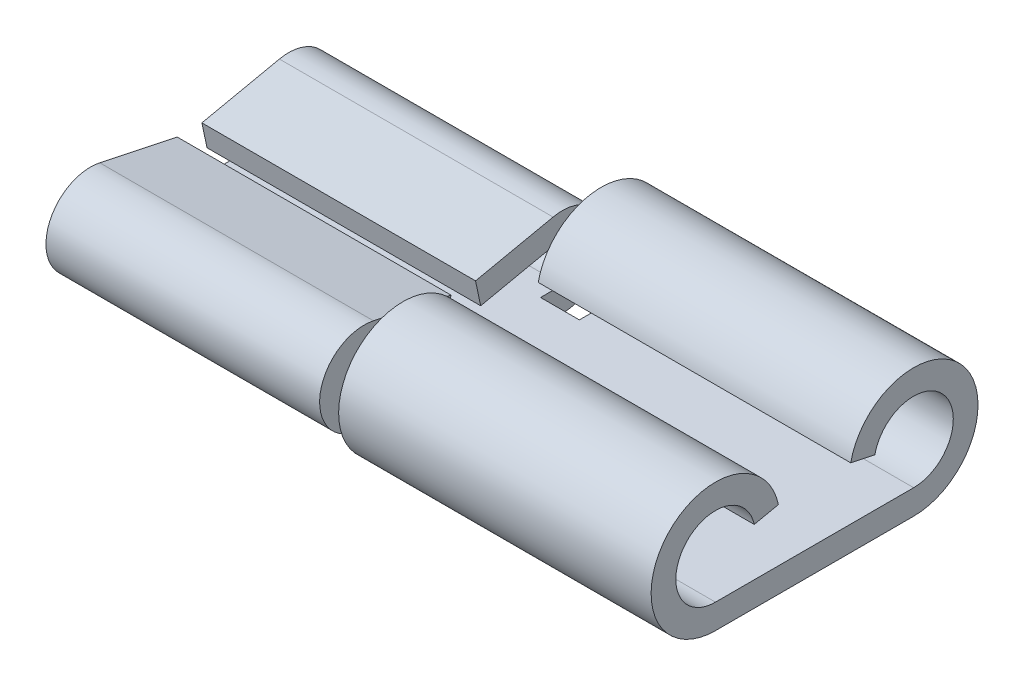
ISO-10303-21;
HEADER;
FILE_DESCRIPTION(('STEP AP214'),'2;1');
FILE_NAME('part.step','',(''),(''),'','','');
FILE_SCHEMA(('AUTOMOTIVE_DESIGN { 1 0 10303 214 1 1 1 1 }'));
ENDSEC;
DATA;
#1=APPLICATION_CONTEXT('core data for automotive mechanical design processes');
#2=APPLICATION_PROTOCOL_DEFINITION('international standard','automotive_design',2000,#1);
#3=PRODUCT_CONTEXT('',#1,'mechanical');
#4=PRODUCT('Part','Part','',(#3));
#5=PRODUCT_RELATED_PRODUCT_CATEGORY('part','',(#4));
#6=PRODUCT_DEFINITION_FORMATION('','',#4);
#7=PRODUCT_DEFINITION_CONTEXT('part definition',#1,'design');
#8=PRODUCT_DEFINITION('design','',#6,#7);
#9=PRODUCT_DEFINITION_SHAPE('','',#8);
#10=(LENGTH_UNIT() NAMED_UNIT(*) SI_UNIT(.MILLI.,.METRE.));
#11=(NAMED_UNIT(*) PLANE_ANGLE_UNIT() SI_UNIT($,.RADIAN.));
#12=(NAMED_UNIT(*) SI_UNIT($,.STERADIAN.) SOLID_ANGLE_UNIT());
#13=UNCERTAINTY_MEASURE_WITH_UNIT(LENGTH_MEASURE(1.E-05),#10,'distance_accuracy_value','');
#14=(GEOMETRIC_REPRESENTATION_CONTEXT(3) GLOBAL_UNCERTAINTY_ASSIGNED_CONTEXT((#13)) GLOBAL_UNIT_ASSIGNED_CONTEXT((#10,
#11,#12)) REPRESENTATION_CONTEXT('',''));
#15=CARTESIAN_POINT('',(0.,0.,0.));
#16=DIRECTION('',(0.,0.,1.));
#17=DIRECTION('',(1.,0.,0.));
#18=AXIS2_PLACEMENT_3D('',#15,#16,#17);
#19=CARTESIAN_POINT('',(-3.37666237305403,0.911796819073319,-0.335088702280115));
#20=DIRECTION('',(0.,-0.207911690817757,0.978147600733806));
#21=DIRECTION('',(0.,-0.978147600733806,-0.207911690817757));
#22=AXIS2_PLACEMENT_3D('',#19,#20,#21);
#23=PLANE('',#22);
#24=DIRECTION('',(1.,0.,0.));
#25=VECTOR('',#24,1.);
#26=CARTESIAN_POINT('',(-3.37666237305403,0.911796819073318,-0.335088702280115));
#27=LINE('',#26,#25);
#28=CARTESIAN_POINT('',(-6.0071,0.911796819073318,-0.335088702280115));
#29=VERTEX_POINT('',#28);
#30=CARTESIAN_POINT('',(-0.746224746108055,0.911796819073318,-0.335088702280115));
#31=VERTEX_POINT('',#30);
#32=EDGE_CURVE('E195',#29,#31,#27,.T.);
#33=ORIENTED_EDGE('',*,*,#32,.T.);
#34=DIRECTION('',(0.,-0.978147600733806,-0.207911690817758));
#35=VECTOR('',#34,1.);
#36=CARTESIAN_POINT('',(-0.746224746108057,1.37639736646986,-0.236334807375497));
#37=LINE('',#36,#35);
#38=CARTESIAN_POINT('',(-0.746224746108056,1.37639736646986,-0.236334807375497));
#39=VERTEX_POINT('',#38);
#40=EDGE_CURVE('E302',#39,#31,#37,.T.);
#41=ORIENTED_EDGE('',*,*,#40,.F.);
#42=DIRECTION('',(1.,0.,0.));
#43=VECTOR('',#42,1.);
#44=CARTESIAN_POINT('',(-3.37666237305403,1.37639736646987,-0.236334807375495));
#45=LINE('',#44,#43);
#46=CARTESIAN_POINT('',(-6.0071,1.37639736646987,-0.236334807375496));
#47=VERTEX_POINT('',#46);
#48=EDGE_CURVE('E201',#47,#39,#45,.T.);
#49=ORIENTED_EDGE('',*,*,#48,.F.);
#50=DIRECTION('',(0.,-0.978147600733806,-0.207911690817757));
#51=VECTOR('',#50,1.);
#52=CARTESIAN_POINT('',(-6.0071,0.911796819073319,-0.335088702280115));
#53=LINE('',#52,#51);
#54=EDGE_CURVE('E188',#47,#29,#53,.T.);
#55=ORIENTED_EDGE('',*,*,#54,.T.);
#56=EDGE_LOOP('',(#33,#41,#49,#55));
#57=FACE_BOUND('',#56,.T.);
#58=ADVANCED_FACE('F17',(#57),#23,.T.);
#59=CARTESIAN_POINT('',(-3.37666237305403,1.62849005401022,-1.4223376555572));
#60=DIRECTION('',(0.,0.978147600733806,0.207911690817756));
#61=DIRECTION('',(0.,-0.207911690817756,0.978147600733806));
#62=AXIS2_PLACEMENT_3D('',#59,#60,#61);
#63=PLANE('',#62);
#64=ORIENTED_EDGE('',*,*,#48,.T.);
#65=DIRECTION('',(0.,-0.207911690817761,0.978147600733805));
#66=VECTOR('',#65,1.);
#67=CARTESIAN_POINT('',(-0.746224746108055,1.69325478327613,-1.72703175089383));
#68=LINE('',#67,#66);
#69=CARTESIAN_POINT('',(-0.746224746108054,1.69325478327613,-1.72703175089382));
#70=VERTEX_POINT('',#69);
#71=EDGE_CURVE('E308',#70,#39,#68,.T.);
#72=ORIENTED_EDGE('',*,*,#71,.F.);
#73=DIRECTION('',(1.,0.,0.));
#74=VECTOR('',#73,1.);
#75=CARTESIAN_POINT('',(-6.00710000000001,1.69325478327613,-1.72703175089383));
#76=LINE('',#75,#74);
#77=CARTESIAN_POINT('',(-6.0071,1.69325478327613,-1.72703175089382));
#78=VERTEX_POINT('',#77);
#79=EDGE_CURVE('E209',#78,#70,#76,.T.);
#80=ORIENTED_EDGE('',*,*,#79,.F.);
#81=DIRECTION('',(0.,-0.207911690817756,0.978147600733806));
#82=VECTOR('',#81,1.);
#83=CARTESIAN_POINT('',(-6.0071,1.62849005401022,-1.4223376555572));
#84=LINE('',#83,#82);
#85=EDGE_CURVE('E203',#78,#47,#84,.T.);
#86=ORIENTED_EDGE('',*,*,#85,.T.);
#87=EDGE_LOOP('',(#64,#72,#80,#86));
#88=FACE_BOUND('',#87,.T.);
#89=ADVANCED_FACE('F328',(#88),#63,.T.);
#90=CARTESIAN_POINT('',(-0.746224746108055,0.,-1.69521083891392));
#91=DIRECTION('',(1.,0.,0.));
#92=DIRECTION('',(0.,0.,-1.));
#93=AXIS2_PLACEMENT_3D('',#90,#91,#92);
#94=PLANE('',#93);
#95=DIRECTION('',(0.,-0.207911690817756,0.978147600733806));
#96=VECTOR('',#95,1.);
#97=CARTESIAN_POINT('',(-0.746224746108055,1.16388950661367,-1.52109155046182));
#98=LINE('',#97,#96);
#99=CARTESIAN_POINT('',(-0.746224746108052,1.22865423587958,-1.82578564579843));
#100=VERTEX_POINT('',#99);
#101=EDGE_CURVE('E207',#31,#100,#98,.F.);
#102=ORIENTED_EDGE('',*,*,#101,.T.);
#103=CARTESIAN_POINT('',(-0.746224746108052,0.85598,-1.905));
#104=DIRECTION('',(1.,0.,0.));
#105=DIRECTION('',(0.,0.,-1.));
#106=AXIS2_PLACEMENT_3D('',#103,#104,#105);
#107=CIRCLE('',#106,0.381000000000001);
#108=CARTESIAN_POINT('',(-0.746224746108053,0.47498,-1.905));
#109=VERTEX_POINT('',#108);
#110=EDGE_CURVE('E20',#100,#109,#107,.F.);
#111=ORIENTED_EDGE('',*,*,#110,.T.);
#112=DIRECTION('',(0.,0.,-1.));
#113=VECTOR('',#112,1.);
#114=CARTESIAN_POINT('',(-0.746224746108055,0.47498,-1.69521083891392));
#115=LINE('',#114,#113);
#116=CARTESIAN_POINT('',(-0.746224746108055,0.47498,-1.48542167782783));
#117=VERTEX_POINT('',#116);
#118=EDGE_CURVE('E234',#109,#117,#115,.F.);
#119=ORIENTED_EDGE('',*,*,#118,.T.);
#120=DIRECTION('',(0.,1.,0.));
#121=VECTOR('',#120,1.);
#122=CARTESIAN_POINT('',(-0.746224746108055,0.,-1.48542167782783));
#123=LINE('',#122,#121);
#124=CARTESIAN_POINT('',(-0.746224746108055,0.,-1.48542167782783));
#125=VERTEX_POINT('',#124);
#126=EDGE_CURVE('E237',#117,#125,#123,.F.);
#127=ORIENTED_EDGE('',*,*,#126,.T.);
#128=DIRECTION('',(0.,0.,-1.));
#129=VECTOR('',#128,1.);
#130=CARTESIAN_POINT('',(-0.746224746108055,0.,-1.69521083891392));
#131=LINE('',#130,#129);
#132=CARTESIAN_POINT('',(-0.746224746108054,0.,-1.905));
#133=VERTEX_POINT('',#132);
#134=EDGE_CURVE('E240',#125,#133,#131,.T.);
#135=ORIENTED_EDGE('',*,*,#134,.T.);
#136=CARTESIAN_POINT('',(-0.746224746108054,0.85598,-1.905));
#137=DIRECTION('',(1.,0.,0.));
#138=DIRECTION('',(0.,1.,0.));
#139=AXIS2_PLACEMENT_3D('',#136,#137,#138);
#140=CIRCLE('',#139,0.855979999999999);
#141=EDGE_CURVE('E292',#70,#133,#140,.F.);
#142=ORIENTED_EDGE('',*,*,#141,.F.);
#143=ORIENTED_EDGE('',*,*,#71,.T.);
#144=ORIENTED_EDGE('',*,*,#40,.T.);
#145=EDGE_LOOP('',(#102,#111,#119,#127,#135,#142,#143,#144));
#146=FACE_BOUND('',#145,.T.);
#147=ADVANCED_FACE('F323',(#146),#94,.T.);
#148=CARTESIAN_POINT('',(-0.746224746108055,0.,1.69521083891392));
#149=DIRECTION('',(1.,0.,0.));
#150=DIRECTION('',(0.,0.,-1.));
#151=AXIS2_PLACEMENT_3D('',#148,#149,#150);
#152=PLANE('',#151);
#153=DIRECTION('',(0.,0.,-1.));
#154=VECTOR('',#153,1.);
#155=CARTESIAN_POINT('',(-0.746224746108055,0.,1.69521083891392));
#156=LINE('',#155,#154);
#157=CARTESIAN_POINT('',(-0.746224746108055,0.,1.905));
#158=VERTEX_POINT('',#157);
#159=CARTESIAN_POINT('',(-0.746224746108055,0.,1.48542167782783));
#160=VERTEX_POINT('',#159);
#161=EDGE_CURVE('E230',#158,#160,#156,.T.);
#162=ORIENTED_EDGE('',*,*,#161,.T.);
#163=DIRECTION('',(0.,1.,0.));
#164=VECTOR('',#163,1.);
#165=CARTESIAN_POINT('',(-0.746224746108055,0.,1.48542167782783));
#166=LINE('',#165,#164);
#167=CARTESIAN_POINT('',(-0.746224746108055,0.47498,1.48542167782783));
#168=VERTEX_POINT('',#167);
#169=EDGE_CURVE('E226',#160,#168,#166,.T.);
#170=ORIENTED_EDGE('',*,*,#169,.T.);
#171=DIRECTION('',(0.,0.,-1.));
#172=VECTOR('',#171,1.);
#173=CARTESIAN_POINT('',(-0.746224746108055,0.47498,1.69521083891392));
#174=LINE('',#173,#172);
#175=CARTESIAN_POINT('',(-0.746224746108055,0.47498,1.905));
#176=VERTEX_POINT('',#175);
#177=EDGE_CURVE('E297',#168,#176,#174,.F.);
#178=ORIENTED_EDGE('',*,*,#177,.T.);
#179=CARTESIAN_POINT('',(-0.746224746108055,0.85598,1.905));
#180=DIRECTION('',(1.,0.,0.));
#181=DIRECTION('',(0.,0.,-1.));
#182=AXIS2_PLACEMENT_3D('',#179,#180,#181);
#183=CIRCLE('',#182,0.381000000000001);
#184=CARTESIAN_POINT('',(-0.746224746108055,1.22865423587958,1.82578564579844));
#185=VERTEX_POINT('',#184);
#186=EDGE_CURVE('E294',#176,#185,#183,.F.);
#187=ORIENTED_EDGE('',*,*,#186,.T.);
#188=DIRECTION('',(0.,-0.207911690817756,-0.978147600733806));
#189=VECTOR('',#188,1.);
#190=CARTESIAN_POINT('',(-0.746224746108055,1.22865423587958,1.82578564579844));
#191=LINE('',#190,#189);
#192=CARTESIAN_POINT('',(-0.746224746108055,0.911796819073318,0.335088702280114));
#193=VERTEX_POINT('',#192);
#194=EDGE_CURVE('E296',#185,#193,#191,.T.);
#195=ORIENTED_EDGE('',*,*,#194,.T.);
#196=DIRECTION('',(0.,0.978147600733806,-0.207911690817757));
#197=VECTOR('',#196,1.);
#198=CARTESIAN_POINT('',(-0.746224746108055,0.911796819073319,0.335088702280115));
#199=LINE('',#198,#197);
#200=CARTESIAN_POINT('',(-0.746224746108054,1.37639736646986,0.236334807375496));
#201=VERTEX_POINT('',#200);
#202=EDGE_CURVE('E222',#201,#193,#199,.F.);
#203=ORIENTED_EDGE('',*,*,#202,.F.);
#204=DIRECTION('',(0.,0.207911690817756,0.978147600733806));
#205=VECTOR('',#204,1.);
#206=CARTESIAN_POINT('',(-0.746224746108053,1.62849005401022,1.4223376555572));
#207=LINE('',#206,#205);
#208=CARTESIAN_POINT('',(-0.746224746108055,1.69325478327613,1.72703175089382));
#209=VERTEX_POINT('',#208);
#210=EDGE_CURVE('E229',#209,#201,#207,.F.);
#211=ORIENTED_EDGE('',*,*,#210,.F.);
#212=CARTESIAN_POINT('',(-0.746224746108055,0.85598,1.905));
#213=DIRECTION('',(1.,0.,0.));
#214=DIRECTION('',(0.,0.,-1.));
#215=AXIS2_PLACEMENT_3D('',#212,#213,#214);
#216=CIRCLE('',#215,0.85598);
#217=EDGE_CURVE('E288',#158,#209,#216,.F.);
#218=ORIENTED_EDGE('',*,*,#217,.F.);
#219=EDGE_LOOP('',(#162,#170,#178,#187,#195,#203,#211,#218));
#220=FACE_BOUND('',#219,.T.);
#221=ADVANCED_FACE('F442',(#220),#152,.T.);
#222=CARTESIAN_POINT('',(-3.37666237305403,1.62849005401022,1.4223376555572));
#223=DIRECTION('',(0.,0.978147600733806,-0.207911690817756));
#224=DIRECTION('',(0.,0.207911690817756,0.978147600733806));
#225=AXIS2_PLACEMENT_3D('',#222,#223,#224);
#226=PLANE('',#225);
#227=DIRECTION('',(1.,0.,0.));
#228=VECTOR('',#227,1.);
#229=CARTESIAN_POINT('',(-3.37666237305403,1.37639736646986,0.236334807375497));
#230=LINE('',#229,#228);
#231=CARTESIAN_POINT('',(-6.0071,1.37639736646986,0.236334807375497));
#232=VERTEX_POINT('',#231);
#233=EDGE_CURVE('E219',#232,#201,#230,.T.);
#234=ORIENTED_EDGE('',*,*,#233,.F.);
#235=DIRECTION('',(0.,0.207911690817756,0.978147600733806));
#236=VECTOR('',#235,1.);
#237=CARTESIAN_POINT('',(-6.0071,1.62849005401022,1.4223376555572));
#238=LINE('',#237,#236);
#239=CARTESIAN_POINT('',(-6.0071,1.69325478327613,1.72703175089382));
#240=VERTEX_POINT('',#239);
#241=EDGE_CURVE('E223',#232,#240,#238,.T.);
#242=ORIENTED_EDGE('',*,*,#241,.T.);
#243=DIRECTION('',(1.,0.,0.));
#244=VECTOR('',#243,1.);
#245=CARTESIAN_POINT('',(-6.0071,1.69325478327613,1.72703175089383));
#246=LINE('',#245,#244);
#247=EDGE_CURVE('E291',#209,#240,#246,.F.);
#248=ORIENTED_EDGE('',*,*,#247,.F.);
#249=ORIENTED_EDGE('',*,*,#210,.T.);
#250=EDGE_LOOP('',(#234,#242,#248,#249));
#251=FACE_BOUND('',#250,.T.);
#252=ADVANCED_FACE('F672',(#251),#226,.T.);
#253=CARTESIAN_POINT('',(-3.37666237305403,0.911796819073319,0.335088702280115));
#254=DIRECTION('',(0.,-0.207911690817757,-0.978147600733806));
#255=DIRECTION('',(0.,0.978147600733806,-0.207911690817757));
#256=AXIS2_PLACEMENT_3D('',#253,#254,#255);
#257=PLANE('',#256);
#258=DIRECTION('',(1.,0.,0.));
#259=VECTOR('',#258,1.);
#260=CARTESIAN_POINT('',(-3.37666237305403,0.911796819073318,0.335088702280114));
#261=LINE('',#260,#259);
#262=CARTESIAN_POINT('',(-6.0071,0.911796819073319,0.335088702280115));
#263=VERTEX_POINT('',#262);
#264=EDGE_CURVE('E385',#193,#263,#261,.F.);
#265=ORIENTED_EDGE('',*,*,#264,.T.);
#266=DIRECTION('',(0.,0.978147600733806,-0.207911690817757));
#267=VECTOR('',#266,1.);
#268=CARTESIAN_POINT('',(-6.0071,0.911796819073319,0.335088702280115));
#269=LINE('',#268,#267);
#270=EDGE_CURVE('E196',#263,#232,#269,.T.);
#271=ORIENTED_EDGE('',*,*,#270,.T.);
#272=ORIENTED_EDGE('',*,*,#233,.T.);
#273=ORIENTED_EDGE('',*,*,#202,.T.);
#274=EDGE_LOOP('',(#265,#271,#272,#273));
#275=FACE_BOUND('',#274,.T.);
#276=ADVANCED_FACE('F664',(#275),#257,.T.);
#277=CARTESIAN_POINT('',(-3.37666237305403,1.16388950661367,-1.52109155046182));
#278=DIRECTION('',(0.,0.978147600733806,0.207911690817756));
#279=DIRECTION('',(0.,-0.207911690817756,0.978147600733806));
#280=AXIS2_PLACEMENT_3D('',#277,#278,#279);
#281=PLANE('',#280);
#282=ORIENTED_EDGE('',*,*,#101,.F.);
#283=ORIENTED_EDGE('',*,*,#32,.F.);
#284=DIRECTION('',(0.,-0.207911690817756,0.978147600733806));
#285=VECTOR('',#284,1.);
#286=CARTESIAN_POINT('',(-6.0071,1.16388950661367,-1.52109155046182));
#287=LINE('',#286,#285);
#288=CARTESIAN_POINT('',(-6.0071,1.22865423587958,-1.82578564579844));
#289=VERTEX_POINT('',#288);
#290=EDGE_CURVE('E184',#289,#29,#287,.T.);
#291=ORIENTED_EDGE('',*,*,#290,.F.);
#292=DIRECTION('',(1.,0.,0.));
#293=VECTOR('',#292,1.);
#294=CARTESIAN_POINT('',(-6.0071,1.22865423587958,-1.82578564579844));
#295=LINE('',#294,#293);
#296=EDGE_CURVE('E277',#289,#100,#295,.T.);
#297=ORIENTED_EDGE('',*,*,#296,.T.);
#298=EDGE_LOOP('',(#282,#283,#291,#297));
#299=FACE_BOUND('',#298,.T.);
#300=ADVANCED_FACE('F206',(#299),#281,.F.);
#301=CARTESIAN_POINT('',(-6.00710000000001,0.855980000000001,-1.905));
#302=DIRECTION('',(1.,0.,0.));
#303=DIRECTION('',(0.,1.,0.));
#304=AXIS2_PLACEMENT_3D('',#301,#302,#303);
#305=CYLINDRICAL_SURFACE('',#304,0.855979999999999);
#306=ORIENTED_EDGE('',*,*,#79,.T.);
#307=ORIENTED_EDGE('',*,*,#141,.T.);
#308=DIRECTION('',(1.,0.,0.));
#309=VECTOR('',#308,1.);
#310=CARTESIAN_POINT('',(-0.0187897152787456,0.,-1.905));
#311=LINE('',#310,#309);
#312=CARTESIAN_POINT('',(-6.0071,0.,-1.905));
#313=VERTEX_POINT('',#312);
#314=EDGE_CURVE('E335',#133,#313,#311,.F.);
#315=ORIENTED_EDGE('',*,*,#314,.T.);
#316=CARTESIAN_POINT('',(-6.0071,0.855980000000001,-1.905));
#317=DIRECTION('',(1.,0.,0.));
#318=DIRECTION('',(0.,1.,0.));
#319=AXIS2_PLACEMENT_3D('',#316,#317,#318);
#320=CIRCLE('',#319,0.855979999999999);
#321=EDGE_CURVE('E273',#78,#313,#320,.F.);
#322=ORIENTED_EDGE('',*,*,#321,.F.);
#323=EDGE_LOOP('',(#306,#307,#315,#322));
#324=FACE_BOUND('',#323,.T.);
#325=ADVANCED_FACE('F333',(#324),#305,.T.);
#326=CARTESIAN_POINT('',(-6.0071,0.85598,1.905));
#327=DIRECTION('',(1.,0.,0.));
#328=DIRECTION('',(0.,0.,-1.));
#329=AXIS2_PLACEMENT_3D('',#326,#327,#328);
#330=CYLINDRICAL_SURFACE('',#329,0.85598);
#331=ORIENTED_EDGE('',*,*,#247,.T.);
#332=CARTESIAN_POINT('',(-6.0071,0.85598,1.905));
#333=DIRECTION('',(1.,0.,0.));
#334=DIRECTION('',(0.,0.,-1.));
#335=AXIS2_PLACEMENT_3D('',#332,#333,#334);
#336=CIRCLE('',#335,0.85598);
#337=CARTESIAN_POINT('',(-6.0071,0.,1.905));
#338=VERTEX_POINT('',#337);
#339=EDGE_CURVE('E268',#338,#240,#336,.F.);
#340=ORIENTED_EDGE('',*,*,#339,.F.);
#341=DIRECTION('',(1.,0.,0.));
#342=VECTOR('',#341,1.);
#343=CARTESIAN_POINT('',(-0.0187897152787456,0.,1.905));
#344=LINE('',#343,#342);
#345=EDGE_CURVE('E286',#338,#158,#344,.T.);
#346=ORIENTED_EDGE('',*,*,#345,.T.);
#347=ORIENTED_EDGE('',*,*,#217,.T.);
#348=EDGE_LOOP('',(#331,#340,#346,#347));
#349=FACE_BOUND('',#348,.T.);
#350=ADVANCED_FACE('F641',(#349),#330,.T.);
#351=CARTESIAN_POINT('',(-3.37666237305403,1.16388950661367,1.52109155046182));
#352=DIRECTION('',(0.,0.978147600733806,-0.207911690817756));
#353=DIRECTION('',(0.,0.207911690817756,0.978147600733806));
#354=AXIS2_PLACEMENT_3D('',#351,#352,#353);
#355=PLANE('',#354);
#356=DIRECTION('',(0.,0.207911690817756,0.978147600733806));
#357=VECTOR('',#356,1.);
#358=CARTESIAN_POINT('',(-6.0071,0.911796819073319,0.335088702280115));
#359=LINE('',#358,#357);
#360=CARTESIAN_POINT('',(-6.0071,1.22865423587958,1.82578564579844));
#361=VERTEX_POINT('',#360);
#362=EDGE_CURVE('E271',#263,#361,#359,.T.);
#363=ORIENTED_EDGE('',*,*,#362,.F.);
#364=ORIENTED_EDGE('',*,*,#264,.F.);
#365=ORIENTED_EDGE('',*,*,#194,.F.);
#366=DIRECTION('',(1.,0.,0.));
#367=VECTOR('',#366,1.);
#368=CARTESIAN_POINT('',(-6.00710000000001,1.22865423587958,1.82578564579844));
#369=LINE('',#368,#367);
#370=EDGE_CURVE('E267',#185,#361,#369,.F.);
#371=ORIENTED_EDGE('',*,*,#370,.T.);
#372=EDGE_LOOP('',(#363,#364,#365,#371));
#373=FACE_BOUND('',#372,.T.);
#374=ADVANCED_FACE('F459',(#373),#355,.F.);
#375=CARTESIAN_POINT('',(6.00709999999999,1.39540870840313,1.15965152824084));
#376=DIRECTION('',(0.,-0.978147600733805,-0.207911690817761));
#377=DIRECTION('',(0.,0.207911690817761,-0.978147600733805));
#378=AXIS2_PLACEMENT_3D('',#375,#376,#377);
#379=PLANE('',#378);
#380=DIRECTION('',(1.,0.,0.));
#381=VECTOR('',#380,1.);
#382=CARTESIAN_POINT('',(0.,1.39540870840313,1.15965152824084));
#383=LINE('',#382,#381);
#384=CARTESIAN_POINT('',(6.00709999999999,1.39540870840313,1.15965152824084));
#385=VERTEX_POINT('',#384);
#386=CARTESIAN_POINT('',(0.,1.39540870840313,1.15965152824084));
#387=VERTEX_POINT('',#386);
#388=EDGE_CURVE('E263',#385,#387,#383,.F.);
#389=ORIENTED_EDGE('',*,*,#388,.T.);
#390=DIRECTION('',(0.,-0.207911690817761,0.978147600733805));
#391=VECTOR('',#390,1.);
#392=CARTESIAN_POINT('',(0.,1.49416260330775,0.695050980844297));
#393=LINE('',#392,#391);
#394=CARTESIAN_POINT('',(0.,1.49416260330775,0.695050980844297));
#395=VERTEX_POINT('',#394);
#396=EDGE_CURVE('E374',#395,#387,#393,.T.);
#397=ORIENTED_EDGE('',*,*,#396,.F.);
#398=DIRECTION('',(1.,0.,0.));
#399=VECTOR('',#398,1.);
#400=CARTESIAN_POINT('',(0.,1.49416260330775,0.695050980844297));
#401=LINE('',#400,#399);
#402=CARTESIAN_POINT('',(6.00709999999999,1.49416260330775,0.695050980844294));
#403=VERTEX_POINT('',#402);
#404=EDGE_CURVE('E287',#403,#395,#401,.F.);
#405=ORIENTED_EDGE('',*,*,#404,.F.);
#406=DIRECTION('',(0.,0.207911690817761,-0.978147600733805));
#407=VECTOR('',#406,1.);
#408=CARTESIAN_POINT('',(6.00709999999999,1.39540870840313,1.15965152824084));
#409=LINE('',#408,#407);
#410=EDGE_CURVE('E381',#403,#385,#409,.F.);
#411=ORIENTED_EDGE('',*,*,#410,.T.);
#412=EDGE_LOOP('',(#389,#397,#405,#411));
#413=FACE_BOUND('',#412,.T.);
#414=ADVANCED_FACE('F489',(#413),#379,.T.);
#415=CARTESIAN_POINT('',(0.,0.,1.69521083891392));
#416=DIRECTION('',(-1.,0.,0.));
#417=DIRECTION('',(0.,0.,1.));
#418=AXIS2_PLACEMENT_3D('',#415,#416,#417);
#419=PLANE('',#418);
#420=ORIENTED_EDGE('',*,*,#396,.T.);
#421=CARTESIAN_POINT('',(0.,1.23698,1.905));
#422=DIRECTION('',(1.,0.,0.));
#423=DIRECTION('',(0.,1.,0.));
#424=AXIS2_PLACEMENT_3D('',#421,#422,#423);
#425=CIRCLE('',#424,0.761999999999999);
#426=CARTESIAN_POINT('',(0.,0.47498,1.905));
#427=VERTEX_POINT('',#426);
#428=EDGE_CURVE('E260',#387,#427,#425,.T.);
#429=ORIENTED_EDGE('',*,*,#428,.T.);
#430=DIRECTION('',(0.,0.,1.));
#431=VECTOR('',#430,1.);
#432=CARTESIAN_POINT('',(0.,0.47498,1.69521083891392));
#433=LINE('',#432,#431);
#434=CARTESIAN_POINT('',(0.,0.47498,1.48542167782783));
#435=VERTEX_POINT('',#434);
#436=EDGE_CURVE('E379',#427,#435,#433,.F.);
#437=ORIENTED_EDGE('',*,*,#436,.T.);
#438=DIRECTION('',(0.,1.,0.));
#439=VECTOR('',#438,1.);
#440=CARTESIAN_POINT('',(0.,0.,1.48542167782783));
#441=LINE('',#440,#439);
#442=CARTESIAN_POINT('',(0.,0.,1.48542167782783));
#443=VERTEX_POINT('',#442);
#444=EDGE_CURVE('E376',#443,#435,#441,.T.);
#445=ORIENTED_EDGE('',*,*,#444,.F.);
#446=DIRECTION('',(0.,0.,1.));
#447=VECTOR('',#446,1.);
#448=CARTESIAN_POINT('',(0.,0.,0.));
#449=LINE('',#448,#447);
#450=CARTESIAN_POINT('',(0.,0.,1.905));
#451=VERTEX_POINT('',#450);
#452=EDGE_CURVE('E371',#443,#451,#449,.T.);
#453=ORIENTED_EDGE('',*,*,#452,.T.);
#454=CARTESIAN_POINT('',(0.,1.23698,1.905));
#455=DIRECTION('',(1.,0.,0.));
#456=DIRECTION('',(0.,0.,-1.));
#457=AXIS2_PLACEMENT_3D('',#454,#455,#456);
#458=CIRCLE('',#457,1.23698);
#459=EDGE_CURVE('E283',#395,#451,#458,.T.);
#460=ORIENTED_EDGE('',*,*,#459,.F.);
#461=EDGE_LOOP('',(#420,#429,#437,#445,#453,#460));
#462=FACE_BOUND('',#461,.T.);
#463=ADVANCED_FACE('F492',(#462),#419,.T.);
#464=CARTESIAN_POINT('',(0.,1.23698,1.905));
#465=DIRECTION('',(1.,0.,0.));
#466=DIRECTION('',(0.,0.,-1.));
#467=AXIS2_PLACEMENT_3D('',#464,#465,#466);
#468=CYLINDRICAL_SURFACE('',#467,1.23698);
#469=ORIENTED_EDGE('',*,*,#404,.T.);
#470=ORIENTED_EDGE('',*,*,#459,.T.);
#471=DIRECTION('',(1.,0.,0.));
#472=VECTOR('',#471,1.);
#473=CARTESIAN_POINT('',(-0.0187897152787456,0.,1.905));
#474=LINE('',#473,#472);
#475=CARTESIAN_POINT('',(6.0071,0.,1.905));
#476=VERTEX_POINT('',#475);
#477=EDGE_CURVE('E369',#451,#476,#474,.T.);
#478=ORIENTED_EDGE('',*,*,#477,.T.);
#479=CARTESIAN_POINT('',(6.0071,1.23698,1.905));
#480=DIRECTION('',(1.,0.,0.));
#481=DIRECTION('',(0.,0.,-1.));
#482=AXIS2_PLACEMENT_3D('',#479,#480,#481);
#483=CIRCLE('',#482,1.23698);
#484=EDGE_CURVE('E254',#403,#476,#483,.T.);
#485=ORIENTED_EDGE('',*,*,#484,.F.);
#486=EDGE_LOOP('',(#469,#470,#478,#485));
#487=FACE_BOUND('',#486,.T.);
#488=ADVANCED_FACE('F495',(#487),#468,.T.);
#489=CARTESIAN_POINT('',(-0.0187897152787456,0.,0.));
#490=DIRECTION('',(0.,1.,0.));
#491=DIRECTION('',(0.,0.,1.));
#492=AXIS2_PLACEMENT_3D('',#489,#490,#491);
#493=PLANE('',#492);
#494=ORIENTED_EDGE('',*,*,#314,.F.);
#495=ORIENTED_EDGE('',*,*,#134,.F.);
#496=DIRECTION('',(1.,0.,0.));
#497=VECTOR('',#496,1.);
#498=CARTESIAN_POINT('',(-0.0187897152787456,0.,-1.48542167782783));
#499=LINE('',#498,#497);
#500=CARTESIAN_POINT('',(0.,0.,-1.48542167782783));
#501=VERTEX_POINT('',#500);
#502=EDGE_CURVE('E148',#501,#125,#499,.F.);
#503=ORIENTED_EDGE('',*,*,#502,.F.);
#504=DIRECTION('',(0.,0.,1.));
#505=VECTOR('',#504,1.);
#506=CARTESIAN_POINT('',(0.,0.,-1.69521083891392));
#507=LINE('',#506,#505);
#508=CARTESIAN_POINT('',(0.,0.,-1.905));
#509=VERTEX_POINT('',#508);
#510=EDGE_CURVE('E281',#509,#501,#507,.T.);
#511=ORIENTED_EDGE('',*,*,#510,.F.);
#512=DIRECTION('',(1.,0.,0.));
#513=VECTOR('',#512,1.);
#514=CARTESIAN_POINT('',(0.,0.,-1.905));
#515=LINE('',#514,#513);
#516=CARTESIAN_POINT('',(6.00709999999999,0.,-1.905));
#517=VERTEX_POINT('',#516);
#518=EDGE_CURVE('E336',#517,#509,#515,.F.);
#519=ORIENTED_EDGE('',*,*,#518,.F.);
#520=DIRECTION('',(0.,0.,-1.));
#521=VECTOR('',#520,1.);
#522=CARTESIAN_POINT('',(6.0071,0.,0.));
#523=LINE('',#522,#521);
#524=EDGE_CURVE('E253',#476,#517,#523,.T.);
#525=ORIENTED_EDGE('',*,*,#524,.F.);
#526=ORIENTED_EDGE('',*,*,#477,.F.);
#527=ORIENTED_EDGE('',*,*,#452,.F.);
#528=DIRECTION('',(1.,0.,0.));
#529=VECTOR('',#528,1.);
#530=CARTESIAN_POINT('',(-0.373112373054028,0.,1.48542167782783));
#531=LINE('',#530,#529);
#532=EDGE_CURVE('E266',#160,#443,#531,.T.);
#533=ORIENTED_EDGE('',*,*,#532,.F.);
#534=ORIENTED_EDGE('',*,*,#161,.F.);
#535=ORIENTED_EDGE('',*,*,#345,.F.);
#536=DIRECTION('',(0.,0.,1.));
#537=VECTOR('',#536,1.);
#538=CARTESIAN_POINT('',(-6.0071,0.,0.));
#539=LINE('',#538,#537);
#540=EDGE_CURVE('E272',#313,#338,#539,.T.);
#541=ORIENTED_EDGE('',*,*,#540,.F.);
#542=EDGE_LOOP('',(#494,#495,#503,#511,#519,#525,#526,#527,#533,#534,#535,#541));
#543=FACE_BOUND('',#542,.T.);
#544=ADVANCED_FACE('F338',(#543),#493,.F.);
#545=CARTESIAN_POINT('',(0.,1.23698,-1.905));
#546=DIRECTION('',(1.,0.,0.));
#547=DIRECTION('',(0.,0.,-1.));
#548=AXIS2_PLACEMENT_3D('',#545,#546,#547);
#549=CYLINDRICAL_SURFACE('',#548,1.23698);
#550=DIRECTION('',(1.,0.,0.));
#551=VECTOR('',#550,1.);
#552=CARTESIAN_POINT('',(0.,1.49416260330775,-0.695050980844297));
#553=LINE('',#552,#551);
#554=CARTESIAN_POINT('',(6.00709999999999,1.49416260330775,-0.695050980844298));
#555=VERTEX_POINT('',#554);
#556=CARTESIAN_POINT('',(0.,1.49416260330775,-0.695050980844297));
#557=VERTEX_POINT('',#556);
#558=EDGE_CURVE('E363',#555,#557,#553,.F.);
#559=ORIENTED_EDGE('',*,*,#558,.F.);
#560=CARTESIAN_POINT('',(6.00709999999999,1.23698,-1.905));
#561=DIRECTION('',(1.,0.,0.));
#562=DIRECTION('',(0.,0.,-1.));
#563=AXIS2_PLACEMENT_3D('',#560,#561,#562);
#564=CIRCLE('',#563,1.23698);
#565=EDGE_CURVE('E249',#517,#555,#564,.T.);
#566=ORIENTED_EDGE('',*,*,#565,.F.);
#567=ORIENTED_EDGE('',*,*,#518,.T.);
#568=CARTESIAN_POINT('',(0.,1.23698,-1.905));
#569=DIRECTION('',(1.,0.,0.));
#570=DIRECTION('',(0.,0.,-1.));
#571=AXIS2_PLACEMENT_3D('',#568,#569,#570);
#572=CIRCLE('',#571,1.23698);
#573=EDGE_CURVE('E278',#557,#509,#572,.F.);
#574=ORIENTED_EDGE('',*,*,#573,.F.);
#575=EDGE_LOOP('',(#559,#566,#567,#574));
#576=FACE_BOUND('',#575,.T.);
#577=ADVANCED_FACE('F499',(#576),#549,.T.);
#578=CARTESIAN_POINT('',(0.,1.39540870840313,-1.15965152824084));
#579=DIRECTION('',(0.,-0.978147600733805,0.207911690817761));
#580=DIRECTION('',(0.,-0.207911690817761,-0.978147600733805));
#581=AXIS2_PLACEMENT_3D('',#578,#579,#580);
#582=PLANE('',#581);
#583=DIRECTION('',(1.,0.,0.));
#584=VECTOR('',#583,1.);
#585=CARTESIAN_POINT('',(0.,1.39540870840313,-1.15965152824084));
#586=LINE('',#585,#584);
#587=CARTESIAN_POINT('',(0.,1.39540870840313,-1.15965152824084));
#588=VERTEX_POINT('',#587);
#589=CARTESIAN_POINT('',(6.0071,1.39540870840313,-1.15965152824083));
#590=VERTEX_POINT('',#589);
#591=EDGE_CURVE('E248',#588,#590,#586,.T.);
#592=ORIENTED_EDGE('',*,*,#591,.T.);
#593=DIRECTION('',(0.,-0.207911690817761,-0.978147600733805));
#594=VECTOR('',#593,1.);
#595=CARTESIAN_POINT('',(6.0071,1.49416260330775,-0.695050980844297));
#596=LINE('',#595,#594);
#597=EDGE_CURVE('E252',#555,#590,#596,.T.);
#598=ORIENTED_EDGE('',*,*,#597,.F.);
#599=ORIENTED_EDGE('',*,*,#558,.T.);
#600=DIRECTION('',(0.,0.207911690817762,0.978147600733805));
#601=VECTOR('',#600,1.);
#602=CARTESIAN_POINT('',(0.,1.39540870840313,-1.15965152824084));
#603=LINE('',#602,#601);
#604=EDGE_CURVE('E282',#588,#557,#603,.T.);
#605=ORIENTED_EDGE('',*,*,#604,.F.);
#606=EDGE_LOOP('',(#592,#598,#599,#605));
#607=FACE_BOUND('',#606,.T.);
#608=ADVANCED_FACE('F500',(#607),#582,.T.);
#609=CARTESIAN_POINT('',(0.,0.,-1.69521083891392));
#610=DIRECTION('',(-1.,0.,0.));
#611=DIRECTION('',(0.,0.,1.));
#612=AXIS2_PLACEMENT_3D('',#609,#610,#611);
#613=PLANE('',#612);
#614=ORIENTED_EDGE('',*,*,#510,.T.);
#615=DIRECTION('',(0.,1.,0.));
#616=VECTOR('',#615,1.);
#617=CARTESIAN_POINT('',(0.,0.,-1.48542167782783));
#618=LINE('',#617,#616);
#619=CARTESIAN_POINT('',(0.,0.47498,-1.48542167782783));
#620=VERTEX_POINT('',#619);
#621=EDGE_CURVE('E357',#501,#620,#618,.T.);
#622=ORIENTED_EDGE('',*,*,#621,.T.);
#623=DIRECTION('',(0.,0.,1.));
#624=VECTOR('',#623,1.);
#625=CARTESIAN_POINT('',(0.,0.47498,-1.69521083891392));
#626=LINE('',#625,#624);
#627=CARTESIAN_POINT('',(0.,0.47498,-1.905));
#628=VERTEX_POINT('',#627);
#629=EDGE_CURVE('E35',#620,#628,#626,.F.);
#630=ORIENTED_EDGE('',*,*,#629,.T.);
#631=CARTESIAN_POINT('',(0.,1.23698,-1.905));
#632=DIRECTION('',(1.,0.,0.));
#633=DIRECTION('',(0.,0.,-1.));
#634=AXIS2_PLACEMENT_3D('',#631,#632,#633);
#635=CIRCLE('',#634,0.762000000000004);
#636=EDGE_CURVE('E243',#628,#588,#635,.T.);
#637=ORIENTED_EDGE('',*,*,#636,.T.);
#638=ORIENTED_EDGE('',*,*,#604,.T.);
#639=ORIENTED_EDGE('',*,*,#573,.T.);
#640=EDGE_LOOP('',(#614,#622,#630,#637,#638,#639));
#641=FACE_BOUND('',#640,.T.);
#642=ADVANCED_FACE('F501',(#641),#613,.T.);
#643=CARTESIAN_POINT('',(-6.0071,0.85598,-1.905));
#644=DIRECTION('',(1.,0.,0.));
#645=DIRECTION('',(0.,0.,-1.));
#646=AXIS2_PLACEMENT_3D('',#643,#644,#645);
#647=CYLINDRICAL_SURFACE('',#646,0.381000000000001);
#648=DIRECTION('',(1.,0.,0.));
#649=VECTOR('',#648,1.);
#650=CARTESIAN_POINT('',(-0.0187897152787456,0.47498,-1.905));
#651=LINE('',#650,#649);
#652=CARTESIAN_POINT('',(-6.0071,0.47498,-1.905));
#653=VERTEX_POINT('',#652);
#654=EDGE_CURVE('E245',#109,#653,#651,.F.);
#655=ORIENTED_EDGE('',*,*,#654,.F.);
#656=ORIENTED_EDGE('',*,*,#110,.F.);
#657=ORIENTED_EDGE('',*,*,#296,.F.);
#658=CARTESIAN_POINT('',(-6.0071,0.85598,-1.905));
#659=DIRECTION('',(1.,0.,0.));
#660=DIRECTION('',(0.,0.,-1.));
#661=AXIS2_PLACEMENT_3D('',#658,#659,#660);
#662=CIRCLE('',#661,0.381000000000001);
#663=EDGE_CURVE('E191',#653,#289,#662,.T.);
#664=ORIENTED_EDGE('',*,*,#663,.F.);
#665=EDGE_LOOP('',(#655,#656,#657,#664));
#666=FACE_BOUND('',#665,.T.);
#667=ADVANCED_FACE('F503',(#666),#647,.F.);
#668=CARTESIAN_POINT('',(-6.0071,0.,0.));
#669=DIRECTION('',(-1.,0.,0.));
#670=DIRECTION('',(0.,0.,1.));
#671=AXIS2_PLACEMENT_3D('',#668,#669,#670);
#672=PLANE('',#671);
#673=ORIENTED_EDGE('',*,*,#362,.T.);
#674=CARTESIAN_POINT('',(-6.00710000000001,0.855980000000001,1.905));
#675=DIRECTION('',(1.,0.,0.));
#676=DIRECTION('',(0.,0.,-1.));
#677=AXIS2_PLACEMENT_3D('',#674,#675,#676);
#678=CIRCLE('',#677,0.381000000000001);
#679=CARTESIAN_POINT('',(-6.0071,0.47498,1.905));
#680=VERTEX_POINT('',#679);
#681=EDGE_CURVE('E264',#361,#680,#678,.T.);
#682=ORIENTED_EDGE('',*,*,#681,.T.);
#683=DIRECTION('',(0.,0.,1.));
#684=VECTOR('',#683,1.);
#685=CARTESIAN_POINT('',(-6.0071,0.47498,0.));
#686=LINE('',#685,#684);
#687=EDGE_CURVE('E348',#653,#680,#686,.T.);
#688=ORIENTED_EDGE('',*,*,#687,.F.);
#689=ORIENTED_EDGE('',*,*,#663,.T.);
#690=ORIENTED_EDGE('',*,*,#290,.T.);
#691=ORIENTED_EDGE('',*,*,#54,.F.);
#692=ORIENTED_EDGE('',*,*,#85,.F.);
#693=ORIENTED_EDGE('',*,*,#321,.T.);
#694=ORIENTED_EDGE('',*,*,#540,.T.);
#695=ORIENTED_EDGE('',*,*,#339,.T.);
#696=ORIENTED_EDGE('',*,*,#241,.F.);
#697=ORIENTED_EDGE('',*,*,#270,.F.);
#698=EDGE_LOOP('',(#673,#682,#688,#689,#690,#691,#692,#693,#694,#695,#696,#697));
#699=FACE_BOUND('',#698,.T.);
#700=ADVANCED_FACE('F187',(#699),#672,.T.);
#701=CARTESIAN_POINT('',(-6.00710000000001,0.855980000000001,1.905));
#702=DIRECTION('',(1.,0.,0.));
#703=DIRECTION('',(0.,0.,-1.));
#704=AXIS2_PLACEMENT_3D('',#701,#702,#703);
#705=CYLINDRICAL_SURFACE('',#704,0.381000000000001);
#706=DIRECTION('',(1.,0.,0.));
#707=VECTOR('',#706,1.);
#708=CARTESIAN_POINT('',(-0.0187897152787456,0.47498,1.905));
#709=LINE('',#708,#707);
#710=EDGE_CURVE('E351',#680,#176,#709,.T.);
#711=ORIENTED_EDGE('',*,*,#710,.F.);
#712=ORIENTED_EDGE('',*,*,#681,.F.);
#713=ORIENTED_EDGE('',*,*,#370,.F.);
#714=ORIENTED_EDGE('',*,*,#186,.F.);
#715=EDGE_LOOP('',(#711,#712,#713,#714));
#716=FACE_BOUND('',#715,.T.);
#717=ADVANCED_FACE('F455',(#716),#705,.F.);
#718=CARTESIAN_POINT('',(-0.373112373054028,0.,1.48542167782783));
#719=DIRECTION('',(0.,0.,1.));
#720=DIRECTION('',(1.,0.,0.));
#721=AXIS2_PLACEMENT_3D('',#718,#719,#720);
#722=PLANE('',#721);
#723=ORIENTED_EDGE('',*,*,#532,.T.);
#724=ORIENTED_EDGE('',*,*,#444,.T.);
#725=DIRECTION('',(1.,0.,0.));
#726=VECTOR('',#725,1.);
#727=CARTESIAN_POINT('',(-0.0187897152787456,0.47498,1.48542167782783));
#728=LINE('',#727,#726);
#729=EDGE_CURVE('E354',#168,#435,#728,.T.);
#730=ORIENTED_EDGE('',*,*,#729,.F.);
#731=ORIENTED_EDGE('',*,*,#169,.F.);
#732=EDGE_LOOP('',(#723,#724,#730,#731));
#733=FACE_BOUND('',#732,.T.);
#734=ADVANCED_FACE('F447',(#733),#722,.T.);
#735=CARTESIAN_POINT('',(0.,1.23698,1.905));
#736=DIRECTION('',(1.,0.,0.));
#737=DIRECTION('',(0.,1.,0.));
#738=AXIS2_PLACEMENT_3D('',#735,#736,#737);
#739=CYLINDRICAL_SURFACE('',#738,0.761999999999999);
#740=DIRECTION('',(1.,0.,0.));
#741=VECTOR('',#740,1.);
#742=CARTESIAN_POINT('',(-0.0187897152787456,0.47498,1.905));
#743=LINE('',#742,#741);
#744=CARTESIAN_POINT('',(6.0071,0.47498,1.905));
#745=VERTEX_POINT('',#744);
#746=EDGE_CURVE('E421',#427,#745,#743,.T.);
#747=ORIENTED_EDGE('',*,*,#746,.F.);
#748=ORIENTED_EDGE('',*,*,#428,.F.);
#749=ORIENTED_EDGE('',*,*,#388,.F.);
#750=CARTESIAN_POINT('',(6.0071,1.23698,1.905));
#751=DIRECTION('',(1.,0.,0.));
#752=DIRECTION('',(0.,1.,0.));
#753=AXIS2_PLACEMENT_3D('',#750,#751,#752);
#754=CIRCLE('',#753,0.761999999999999);
#755=EDGE_CURVE('E257',#745,#385,#754,.F.);
#756=ORIENTED_EDGE('',*,*,#755,.F.);
#757=EDGE_LOOP('',(#747,#748,#749,#756));
#758=FACE_BOUND('',#757,.T.);
#759=ADVANCED_FACE('F486',(#758),#739,.F.);
#760=CARTESIAN_POINT('',(6.0071,0.,0.));
#761=DIRECTION('',(1.,0.,0.));
#762=DIRECTION('',(0.,0.,-1.));
#763=AXIS2_PLACEMENT_3D('',#760,#761,#762);
#764=PLANE('',#763);
#765=ORIENTED_EDGE('',*,*,#597,.T.);
#766=CARTESIAN_POINT('',(6.0071,1.23698,-1.905));
#767=DIRECTION('',(1.,0.,0.));
#768=DIRECTION('',(0.,0.,-1.));
#769=AXIS2_PLACEMENT_3D('',#766,#767,#768);
#770=CIRCLE('',#769,0.762000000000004);
#771=CARTESIAN_POINT('',(6.0071,0.47498,-1.905));
#772=VERTEX_POINT('',#771);
#773=EDGE_CURVE('E246',#590,#772,#770,.F.);
#774=ORIENTED_EDGE('',*,*,#773,.T.);
#775=DIRECTION('',(0.,0.,1.));
#776=VECTOR('',#775,1.);
#777=CARTESIAN_POINT('',(6.0071,0.47498,0.));
#778=LINE('',#777,#776);
#779=EDGE_CURVE('E464',#745,#772,#778,.F.);
#780=ORIENTED_EDGE('',*,*,#779,.F.);
#781=ORIENTED_EDGE('',*,*,#755,.T.);
#782=ORIENTED_EDGE('',*,*,#410,.F.);
#783=ORIENTED_EDGE('',*,*,#484,.T.);
#784=ORIENTED_EDGE('',*,*,#524,.T.);
#785=ORIENTED_EDGE('',*,*,#565,.T.);
#786=EDGE_LOOP('',(#765,#774,#780,#781,#782,#783,#784,#785));
#787=FACE_BOUND('',#786,.T.);
#788=ADVANCED_FACE('F474',(#787),#764,.T.);
#789=CARTESIAN_POINT('',(0.,1.23698,-1.905));
#790=DIRECTION('',(1.,0.,0.));
#791=DIRECTION('',(0.,0.,-1.));
#792=AXIS2_PLACEMENT_3D('',#789,#790,#791);
#793=CYLINDRICAL_SURFACE('',#792,0.762000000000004);
#794=DIRECTION('',(1.,0.,0.));
#795=VECTOR('',#794,1.);
#796=CARTESIAN_POINT('',(-0.0187897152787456,0.47498,-1.905));
#797=LINE('',#796,#795);
#798=EDGE_CURVE('E26',#772,#628,#797,.F.);
#799=ORIENTED_EDGE('',*,*,#798,.F.);
#800=ORIENTED_EDGE('',*,*,#773,.F.);
#801=ORIENTED_EDGE('',*,*,#591,.F.);
#802=ORIENTED_EDGE('',*,*,#636,.F.);
#803=EDGE_LOOP('',(#799,#800,#801,#802));
#804=FACE_BOUND('',#803,.T.);
#805=ADVANCED_FACE('F481',(#804),#793,.F.);
#806=CARTESIAN_POINT('',(-0.373112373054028,0.,-1.48542167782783));
#807=DIRECTION('',(0.,0.,-1.));
#808=DIRECTION('',(-1.,0.,0.));
#809=AXIS2_PLACEMENT_3D('',#806,#807,#808);
#810=PLANE('',#809);
#811=ORIENTED_EDGE('',*,*,#502,.T.);
#812=ORIENTED_EDGE('',*,*,#126,.F.);
#813=DIRECTION('',(1.,0.,0.));
#814=VECTOR('',#813,1.);
#815=CARTESIAN_POINT('',(-0.0187897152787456,0.47498,-1.48542167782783));
#816=LINE('',#815,#814);
#817=EDGE_CURVE('E11',#620,#117,#816,.F.);
#818=ORIENTED_EDGE('',*,*,#817,.F.);
#819=ORIENTED_EDGE('',*,*,#621,.F.);
#820=EDGE_LOOP('',(#811,#812,#818,#819));
#821=FACE_BOUND('',#820,.T.);
#822=ADVANCED_FACE('F513',(#821),#810,.T.);
#823=CARTESIAN_POINT('',(-0.0187897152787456,0.47498,0.));
#824=DIRECTION('',(0.,1.,0.));
#825=DIRECTION('',(0.,0.,1.));
#826=AXIS2_PLACEMENT_3D('',#823,#824,#825);
#827=PLANE('',#826);
#828=ORIENTED_EDGE('',*,*,#817,.T.);
#829=ORIENTED_EDGE('',*,*,#118,.F.);
#830=ORIENTED_EDGE('',*,*,#654,.T.);
#831=ORIENTED_EDGE('',*,*,#687,.T.);
#832=ORIENTED_EDGE('',*,*,#710,.T.);
#833=ORIENTED_EDGE('',*,*,#177,.F.);
#834=ORIENTED_EDGE('',*,*,#729,.T.);
#835=ORIENTED_EDGE('',*,*,#436,.F.);
#836=ORIENTED_EDGE('',*,*,#746,.T.);
#837=ORIENTED_EDGE('',*,*,#779,.T.);
#838=ORIENTED_EDGE('',*,*,#798,.T.);
#839=ORIENTED_EDGE('',*,*,#629,.F.);
#840=EDGE_LOOP('',(#828,#829,#830,#831,#832,#833,#834,#835,#836,#837,#838,#839));
#841=FACE_BOUND('',#840,.T.);
#842=ADVANCED_FACE('F450',(#841),#827,.T.);
#843=CLOSED_SHELL('',(#58,#89,#147,#221,#252,#276,#300,#325,#350,#374,#414,#463,#488,#544,#577,
#608,#642,#667,#700,#717,#734,#759,#788,#805,#822,#842));
#844=MANIFOLD_SOLID_BREP('B1',#843);
#845=ADVANCED_BREP_SHAPE_REPRESENTATION('',(#18,#844),#14);
#846=SHAPE_DEFINITION_REPRESENTATION(#9,#845);
ENDSEC;
END-ISO-10303-21;
